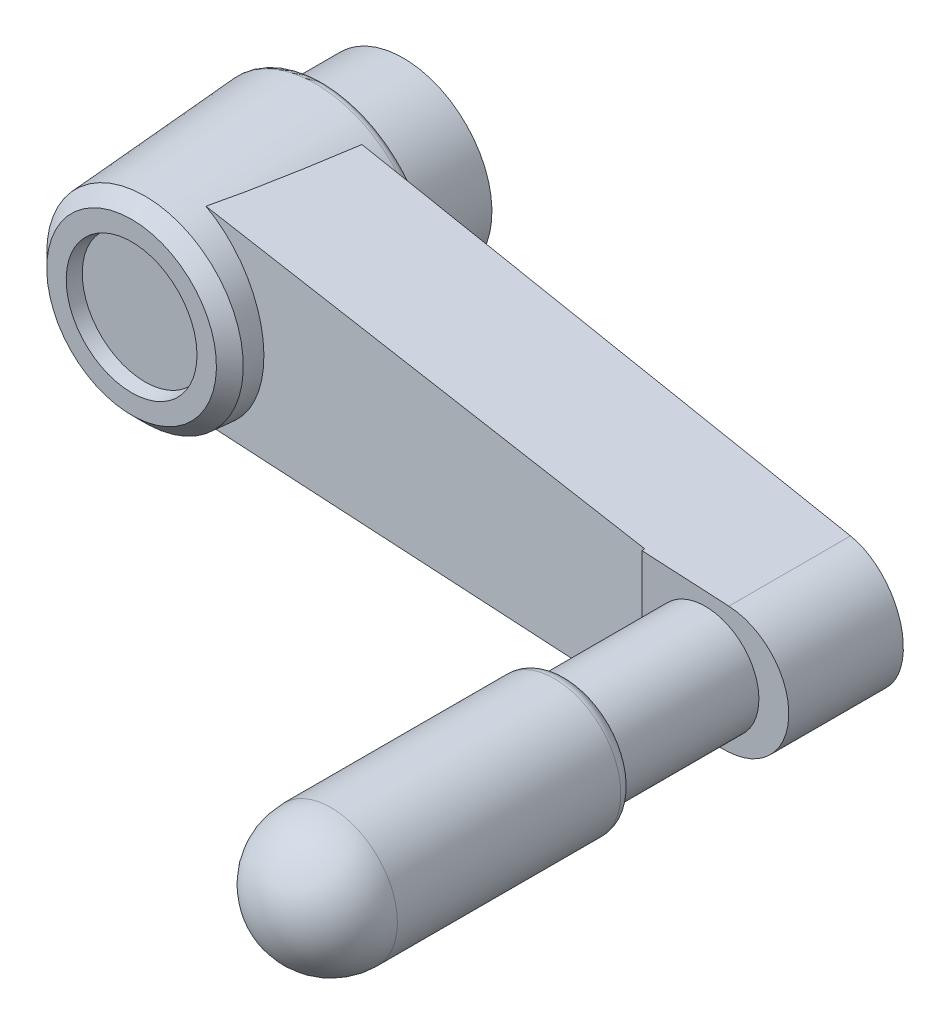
ISO-10303-21;
HEADER;
FILE_DESCRIPTION(('STEP AP214'),'2;1');
FILE_NAME('part.step','',(''),(''),'','','');
FILE_SCHEMA(('AUTOMOTIVE_DESIGN { 1 0 10303 214 1 1 1 1 }'));
ENDSEC;
DATA;
#1=APPLICATION_CONTEXT('core data for automotive mechanical design processes');
#2=APPLICATION_PROTOCOL_DEFINITION('international standard','automotive_design',2000,#1);
#3=PRODUCT_CONTEXT('',#1,'mechanical');
#4=PRODUCT('Part','Part','',(#3));
#5=PRODUCT_RELATED_PRODUCT_CATEGORY('part','',(#4));
#6=PRODUCT_DEFINITION_FORMATION('','',#4);
#7=PRODUCT_DEFINITION_CONTEXT('part definition',#1,'design');
#8=PRODUCT_DEFINITION('design','',#6,#7);
#9=PRODUCT_DEFINITION_SHAPE('','',#8);
#10=(LENGTH_UNIT() NAMED_UNIT(*) SI_UNIT(.MILLI.,.METRE.));
#11=(NAMED_UNIT(*) PLANE_ANGLE_UNIT() SI_UNIT($,.RADIAN.));
#12=(NAMED_UNIT(*) SI_UNIT($,.STERADIAN.) SOLID_ANGLE_UNIT());
#13=UNCERTAINTY_MEASURE_WITH_UNIT(LENGTH_MEASURE(1.E-05),#10,'distance_accuracy_value','');
#14=(GEOMETRIC_REPRESENTATION_CONTEXT(3) GLOBAL_UNCERTAINTY_ASSIGNED_CONTEXT((#13)) GLOBAL_UNIT_ASSIGNED_CONTEXT((#10,
#11,#12)) REPRESENTATION_CONTEXT('',''));
#15=CARTESIAN_POINT('',(0.,0.,0.));
#16=DIRECTION('',(0.,0.,1.));
#17=DIRECTION('',(1.,0.,0.));
#18=AXIS2_PLACEMENT_3D('',#15,#16,#17);
#19=CARTESIAN_POINT('',(0.,0.,24.9999999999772));
#20=DIRECTION('',(0.,0.,-1.));
#21=DIRECTION('',(0.,1.,0.));
#22=AXIS2_PLACEMENT_3D('',#19,#20,#21);
#23=CONICAL_SURFACE('',#22,4.99999999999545,1.04719755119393);
#24=CARTESIAN_POINT('',(5.6843418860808E-11,0.,27.8867513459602));
#25=VERTEX_POINT('',#24);
#26=VERTEX_LOOP('',#25);
#27=FACE_BOUND('',#26,.T.);
#28=CARTESIAN_POINT('',(0.,0.,25.));
#29=DIRECTION('',(0.,0.,-1.));
#30=DIRECTION('',(0.,1.,0.));
#31=AXIS2_PLACEMENT_3D('',#28,#29,#30);
#32=CIRCLE('',#31,5.);
#33=CARTESIAN_POINT('',(0.,5.,25.));
#34=VERTEX_POINT('',#33);
#35=EDGE_CURVE('E297',#34,#34,#32,.T.);
#36=ORIENTED_EDGE('',*,*,#35,.T.);
#37=EDGE_LOOP('',(#36));
#38=FACE_BOUND('',#37,.T.);
#39=ADVANCED_FACE('F15',(#27,#38),#23,.F.);
#40=CARTESIAN_POINT('',(0.,0.,12.875));
#41=DIRECTION('',(0.,0.,-1.));
#42=DIRECTION('',(0.,1.,0.));
#43=AXIS2_PLACEMENT_3D('',#40,#41,#42);
#44=CYLINDRICAL_SURFACE('',#43,5.);
#45=CARTESIAN_POINT('',(0.,0.,0.749999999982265));
#46=DIRECTION('',(0.,0.,-1.));
#47=DIRECTION('',(1.,0.,0.));
#48=AXIS2_PLACEMENT_3D('',#45,#46,#47);
#49=CIRCLE('',#48,5.0000000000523);
#50=CARTESIAN_POINT('',(5.0000000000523,0.,0.749999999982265));
#51=VERTEX_POINT('',#50);
#52=EDGE_CURVE('E288',#51,#51,#49,.T.);
#53=ORIENTED_EDGE('',*,*,#52,.T.);
#54=EDGE_LOOP('',(#53));
#55=FACE_BOUND('',#54,.T.);
#56=ORIENTED_EDGE('',*,*,#35,.F.);
#57=EDGE_LOOP('',(#56));
#58=FACE_BOUND('',#57,.T.);
#59=ADVANCED_FACE('F400',(#55,#58),#44,.F.);
#60=CARTESIAN_POINT('',(0.,0.,5.6843418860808E-11));
#61=DIRECTION('',(0.,0.,-1.));
#62=DIRECTION('',(0.,1.,0.));
#63=AXIS2_PLACEMENT_3D('',#60,#61,#62);
#64=CONICAL_SURFACE('',#63,5.74999999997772,0.785398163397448);
#65=CARTESIAN_POINT('',(0.,0.,5.6843418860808E-11));
#66=DIRECTION('',(0.,0.,-1.));
#67=DIRECTION('',(0.,1.,0.));
#68=AXIS2_PLACEMENT_3D('',#65,#66,#67);
#69=CIRCLE('',#68,5.74999999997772);
#70=CARTESIAN_POINT('',(0.,5.74999999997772,5.6843418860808E-11));
#71=VERTEX_POINT('',#70);
#72=EDGE_CURVE('E285',#71,#71,#69,.F.);
#73=ORIENTED_EDGE('',*,*,#72,.F.);
#74=EDGE_LOOP('',(#73));
#75=FACE_BOUND('',#74,.T.);
#76=ORIENTED_EDGE('',*,*,#52,.F.);
#77=EDGE_LOOP('',(#76));
#78=FACE_BOUND('',#77,.T.);
#79=ADVANCED_FACE('F405',(#75,#78),#64,.F.);
#80=CARTESIAN_POINT('',(-4.5,0.,0.));
#81=DIRECTION('',(0.,0.,-1.));
#82=DIRECTION('',(0.,1.,0.));
#83=AXIS2_PLACEMENT_3D('',#80,#81,#82);
#84=PLANE('',#83);
#85=CARTESIAN_POINT('',(0.,0.,0.));
#86=DIRECTION('',(0.,0.,1.));
#87=DIRECTION('',(0.,-1.,0.));
#88=AXIS2_PLACEMENT_3D('',#85,#86,#87);
#89=CIRCLE('',#88,9.);
#90=CARTESIAN_POINT('',(0.,-9.,0.));
#91=VERTEX_POINT('',#90);
#92=EDGE_CURVE('E282',#91,#91,#89,.T.);
#93=ORIENTED_EDGE('',*,*,#92,.F.);
#94=EDGE_LOOP('',(#93));
#95=FACE_BOUND('',#94,.T.);
#96=ORIENTED_EDGE('',*,*,#72,.T.);
#97=EDGE_LOOP('',(#96));
#98=FACE_BOUND('',#97,.T.);
#99=ADVANCED_FACE('F521',(#95,#98),#84,.T.);
#100=CARTESIAN_POINT('',(0.,0.,0.0999999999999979));
#101=DIRECTION('',(0.,0.,1.));
#102=DIRECTION('',(0.,-1.,0.));
#103=AXIS2_PLACEMENT_3D('',#100,#101,#102);
#104=CYLINDRICAL_SURFACE('',#103,9.);
#105=ORIENTED_EDGE('',*,*,#92,.T.);
#106=EDGE_LOOP('',(#105));
#107=FACE_BOUND('',#106,.T.);
#108=CARTESIAN_POINT('',(0.,0.,0.199999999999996));
#109=DIRECTION('',(0.,0.,1.));
#110=DIRECTION('',(0.,-1.,0.));
#111=AXIS2_PLACEMENT_3D('',#108,#109,#110);
#112=CIRCLE('',#111,9.);
#113=CARTESIAN_POINT('',(0.,-9.,0.199999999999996));
#114=VERTEX_POINT('',#113);
#115=EDGE_CURVE('E279',#114,#114,#112,.T.);
#116=ORIENTED_EDGE('',*,*,#115,.F.);
#117=EDGE_LOOP('',(#116));
#118=FACE_BOUND('',#117,.T.);
#119=ADVANCED_FACE('F517',(#107,#118),#104,.T.);
#120=CARTESIAN_POINT('',(-10.5,0.,0.199999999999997));
#121=DIRECTION('',(0.,0.,-1.));
#122=DIRECTION('',(1.,0.,0.));
#123=AXIS2_PLACEMENT_3D('',#120,#121,#122);
#124=PLANE('',#123);
#125=CARTESIAN_POINT('',(0.,0.,0.2));
#126=DIRECTION('',(0.,0.,1.));
#127=DIRECTION('',(0.,-1.,0.));
#128=AXIS2_PLACEMENT_3D('',#125,#126,#127);
#129=CIRCLE('',#128,12.);
#130=CARTESIAN_POINT('',(0.,-12.,0.2));
#131=VERTEX_POINT('',#130);
#132=EDGE_CURVE('E272',#131,#131,#129,.T.);
#133=ORIENTED_EDGE('',*,*,#132,.F.);
#134=EDGE_LOOP('',(#133));
#135=FACE_BOUND('',#134,.T.);
#136=ORIENTED_EDGE('',*,*,#115,.T.);
#137=EDGE_LOOP('',(#136));
#138=FACE_BOUND('',#137,.T.);
#139=ADVANCED_FACE('F512',(#135,#138),#124,.T.);
#140=CARTESIAN_POINT('',(-4.25,0.,35.18));
#141=DIRECTION('',(0.,0.,1.));
#142=DIRECTION('',(0.,-1.,0.));
#143=AXIS2_PLACEMENT_3D('',#140,#141,#142);
#144=PLANE('',#143);
#145=CARTESIAN_POINT('',(0.,0.,35.18));
#146=DIRECTION('',(0.,0.,1.));
#147=DIRECTION('',(0.,-1.,0.));
#148=AXIS2_PLACEMENT_3D('',#145,#146,#147);
#149=CIRCLE('',#148,8.5);
#150=CARTESIAN_POINT('',(0.,-8.5,35.18));
#151=VERTEX_POINT('',#150);
#152=EDGE_CURVE('E264',#151,#151,#149,.T.);
#153=ORIENTED_EDGE('',*,*,#152,.T.);
#154=EDGE_LOOP('',(#153));
#155=FACE_BOUND('',#154,.T.);
#156=ADVANCED_FACE('F243',(#155),#144,.T.);
#157=CARTESIAN_POINT('',(0.,0.,5.6));
#158=DIRECTION('',(0.,0.,1.));
#159=DIRECTION('',(0.,-1.,0.));
#160=AXIS2_PLACEMENT_3D('',#157,#158,#159);
#161=CYLINDRICAL_SURFACE('',#160,12.);
#162=ORIENTED_EDGE('',*,*,#132,.T.);
#163=EDGE_LOOP('',(#162));
#164=FACE_BOUND('',#163,.T.);
#165=CARTESIAN_POINT('',(0.,0.,11.));
#166=DIRECTION('',(0.,0.,1.));
#167=DIRECTION('',(0.,-1.,0.));
#168=AXIS2_PLACEMENT_3D('',#165,#166,#167);
#169=CIRCLE('',#168,12.);
#170=CARTESIAN_POINT('',(0.,-12.,11.));
#171=VERTEX_POINT('',#170);
#172=EDGE_CURVE('E267',#171,#171,#169,.T.);
#173=ORIENTED_EDGE('',*,*,#172,.F.);
#174=EDGE_LOOP('',(#173));
#175=FACE_BOUND('',#174,.T.);
#176=ADVANCED_FACE('F504',(#164,#175),#161,.T.);
#177=CARTESIAN_POINT('',(0.,0.,37.));
#178=DIRECTION('',(0.,0.,1.));
#179=DIRECTION('',(0.,-1.,0.));
#180=AXIS2_PLACEMENT_3D('',#177,#178,#179);
#181=CONICAL_SURFACE('',#180,8.85377216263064,0.191986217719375);
#182=CARTESIAN_POINT('',(0.,0.,37.));
#183=DIRECTION('',(0.,0.,1.));
#184=DIRECTION('',(0.,-1.,0.));
#185=AXIS2_PLACEMENT_3D('',#182,#183,#184);
#186=CIRCLE('',#185,8.85377216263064);
#187=CARTESIAN_POINT('',(0.,-8.85377216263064,37.));
#188=VERTEX_POINT('',#187);
#189=EDGE_CURVE('E218',#188,#188,#186,.F.);
#190=ORIENTED_EDGE('',*,*,#189,.F.);
#191=EDGE_LOOP('',(#190));
#192=FACE_BOUND('',#191,.T.);
#193=ORIENTED_EDGE('',*,*,#152,.F.);
#194=EDGE_LOOP('',(#193));
#195=FACE_BOUND('',#194,.T.);
#196=ADVANCED_FACE('F241',(#192,#195),#181,.F.);
#197=CARTESIAN_POINT('',(-12.9638156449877,0.,11.));
#198=DIRECTION('',(0.,0.,-1.));
#199=DIRECTION('',(1.,0.,0.));
#200=AXIS2_PLACEMENT_3D('',#197,#198,#199);
#201=PLANE('',#200);
#202=CARTESIAN_POINT('',(0.,0.,11.));
#203=DIRECTION('',(0.,0.,1.));
#204=DIRECTION('',(0.,-1.,0.));
#205=AXIS2_PLACEMENT_3D('',#202,#203,#204);
#206=CIRCLE('',#205,13.9276312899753);
#207=CARTESIAN_POINT('',(0.,-13.9276312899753,11.));
#208=VERTEX_POINT('',#207);
#209=CARTESIAN_POINT('',(0.,13.9276312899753,11.));
#210=VERTEX_POINT('',#209);
#211=EDGE_CURVE('E148',#208,#210,#206,.T.);
#212=ORIENTED_EDGE('',*,*,#211,.F.);
#213=CARTESIAN_POINT('',(0.,0.,11.));
#214=DIRECTION('',(0.,0.,1.));
#215=DIRECTION('',(-1.,0.,0.));
#216=AXIS2_PLACEMENT_3D('',#213,#214,#215);
#217=CIRCLE('',#216,13.9276312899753);
#218=CARTESIAN_POINT('',(-13.9276312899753,0.,11.));
#219=VERTEX_POINT('',#218);
#220=EDGE_CURVE('E260',#219,#208,#217,.T.);
#221=ORIENTED_EDGE('',*,*,#220,.F.);
#222=CARTESIAN_POINT('',(0.,0.,11.));
#223=DIRECTION('',(0.,0.,1.));
#224=DIRECTION('',(0.,1.,0.));
#225=AXIS2_PLACEMENT_3D('',#222,#223,#224);
#226=CIRCLE('',#225,13.9276312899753);
#227=EDGE_CURVE('E224',#210,#219,#226,.T.);
#228=ORIENTED_EDGE('',*,*,#227,.F.);
#229=EDGE_LOOP('',(#212,#221,#228));
#230=FACE_BOUND('',#229,.T.);
#231=ORIENTED_EDGE('',*,*,#172,.T.);
#232=EDGE_LOOP('',(#231));
#233=FACE_BOUND('',#232,.T.);
#234=ADVANCED_FACE('F230',(#230,#233),#201,.T.);
#235=CARTESIAN_POINT('',(-10.1714709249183,0.,37.));
#236=DIRECTION('',(0.,0.,1.));
#237=DIRECTION('',(0.,-1.,0.));
#238=AXIS2_PLACEMENT_3D('',#235,#236,#237);
#239=PLANE('',#238);
#240=ORIENTED_EDGE('',*,*,#189,.T.);
#241=EDGE_LOOP('',(#240));
#242=FACE_BOUND('',#241,.T.);
#243=CARTESIAN_POINT('',(0.,0.,37.));
#244=DIRECTION('',(0.,0.,-1.));
#245=DIRECTION('',(0.,1.,0.));
#246=AXIS2_PLACEMENT_3D('',#243,#244,#245);
#247=CIRCLE('',#246,11.4891696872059);
#248=CARTESIAN_POINT('',(0.,11.4891696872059,37.));
#249=VERTEX_POINT('',#248);
#250=EDGE_CURVE('E198',#249,#249,#247,.T.);
#251=ORIENTED_EDGE('',*,*,#250,.F.);
#252=EDGE_LOOP('',(#251));
#253=FACE_BOUND('',#252,.T.);
#254=ADVANCED_FACE('F240',(#242,#253),#239,.T.);
#255=CARTESIAN_POINT('',(0.,0.,35.18));
#256=DIRECTION('',(0.,0.,-1.));
#257=DIRECTION('',(0.,1.,0.));
#258=AXIS2_PLACEMENT_3D('',#255,#256,#257);
#259=CONICAL_SURFACE('',#258,13.3091696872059,0.785398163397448);
#260=CARTESIAN_POINT('',(0.,0.,35.18));
#261=DIRECTION('',(0.,0.,-1.));
#262=DIRECTION('',(-1.,0.,0.));
#263=AXIS2_PLACEMENT_3D('',#260,#261,#262);
#264=CIRCLE('',#263,13.3091696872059);
#265=CARTESIAN_POINT('',(-13.3091696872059,0.,35.18));
#266=VERTEX_POINT('',#265);
#267=EDGE_CURVE('E178',#266,#266,#264,.T.);
#268=ORIENTED_EDGE('',*,*,#267,.F.);
#269=EDGE_LOOP('',(#268));
#270=FACE_BOUND('',#269,.T.);
#271=ORIENTED_EDGE('',*,*,#250,.T.);
#272=EDGE_LOOP('',(#271));
#273=FACE_BOUND('',#272,.T.);
#274=ADVANCED_FACE('F167',(#270,#273),#259,.T.);
#275=CARTESIAN_POINT('',(0.,0.,12.));
#276=DIRECTION('',(0.,0.,-1.));
#277=DIRECTION('',(0.,1.,0.));
#278=AXIS2_PLACEMENT_3D('',#275,#276,#277);
#279=TOROIDAL_SURFACE('',#278,13.9276312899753,1.);
#280=ORIENTED_EDGE('',*,*,#220,.T.);
#281=ORIENTED_EDGE('',*,*,#211,.T.);
#282=ORIENTED_EDGE('',*,*,#227,.T.);
#283=EDGE_LOOP('',(#280,#281,#282));
#284=FACE_BOUND('',#283,.T.);
#285=CARTESIAN_POINT('',(0.,0.,12.0697564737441));
#286=DIRECTION('',(0.,0.,-1.));
#287=DIRECTION('',(-1.,0.,0.));
#288=AXIS2_PLACEMENT_3D('',#285,#286,#287);
#289=CIRCLE('',#288,14.9251953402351);
#290=CARTESIAN_POINT('',(-14.9251953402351,0.,12.0697564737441));
#291=VERTEX_POINT('',#290);
#292=EDGE_CURVE('E176',#291,#291,#289,.F.);
#293=ORIENTED_EDGE('',*,*,#292,.F.);
#294=EDGE_LOOP('',(#293));
#295=FACE_BOUND('',#294,.T.);
#296=ADVANCED_FACE('F155',(#284,#295),#279,.T.);
#297=CARTESIAN_POINT('',(-14.9,-26.,29.6));
#298=DIRECTION('',(0.104082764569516,0.,-0.994568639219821));
#299=DIRECTION('',(0.994568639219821,0.,0.104082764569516));
#300=AXIS2_PLACEMENT_3D('',#297,#298,#299);
#301=PLANE('',#300);
#302=CARTESIAN_POINT('',(-0.0994582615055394,0.,31.1488939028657));
#303=DIRECTION('',(0.104082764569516,0.,-0.994568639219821));
#304=DIRECTION('',(-0.994568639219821,0.,-0.104082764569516));
#305=AXIS2_PLACEMENT_3D('',#302,#303,#304);
#306=ELLIPSE('',#305,13.6652731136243,13.5906881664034);
#307=CARTESIAN_POINT('',(4.71940161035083,-12.7077392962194,31.6531931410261));
#308=VERTEX_POINT('',#307);
#309=CARTESIAN_POINT('',(4.71940160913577,12.7077392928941,31.6531931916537));
#310=VERTEX_POINT('',#309);
#311=EDGE_CURVE('E182',#308,#310,#306,.F.);
#312=ORIENTED_EDGE('',*,*,#311,.F.);
#313=DIRECTION('',(-0.993185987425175,-0.0527112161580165,-0.103938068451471));
#314=VECTOR('',#313,1.);
#315=CARTESIAN_POINT('',(71.1,-9.18473140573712,38.6));
#316=LINE('',#315,#314);
#317=CARTESIAN_POINT('',(71.1,-9.18473140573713,38.6));
#318=VERTEX_POINT('',#317);
#319=EDGE_CURVE('E204',#318,#308,#316,.T.);
#320=ORIENTED_EDGE('',*,*,#319,.F.);
#321=DIRECTION('',(0.,-1.,0.));
#322=VECTOR('',#321,1.);
#323=CARTESIAN_POINT('',(71.1,-26.,38.6));
#324=LINE('',#323,#322);
#325=CARTESIAN_POINT('',(71.1,9.18473140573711,38.6));
#326=VERTEX_POINT('',#325);
#327=EDGE_CURVE('E192',#326,#318,#324,.T.);
#328=ORIENTED_EDGE('',*,*,#327,.F.);
#329=DIRECTION('',(0.993185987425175,-0.0527112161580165,0.103938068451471));
#330=VECTOR('',#329,1.);
#331=CARTESIAN_POINT('',(4.71940159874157,12.7077392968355,31.653193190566));
#332=LINE('',#331,#330);
#333=EDGE_CURVE('E186',#310,#326,#332,.T.);
#334=ORIENTED_EDGE('',*,*,#333,.F.);
#335=EDGE_LOOP('',(#312,#320,#328,#334));
#336=FACE_BOUND('',#335,.T.);
#337=ADVANCED_FACE('F166',(#336),#301,.F.);
#338=CARTESIAN_POINT('',(0.,0.,12.0697564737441));
#339=DIRECTION('',(0.,0.,-1.));
#340=DIRECTION('',(0.,1.,0.));
#341=AXIS2_PLACEMENT_3D('',#338,#339,#340);
#342=CONICAL_SURFACE('',#341,14.9251953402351,0.0698131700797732);
#343=ORIENTED_EDGE('',*,*,#292,.T.);
#344=EDGE_LOOP('',(#343));
#345=FACE_BOUND('',#344,.T.);
#346=CARTESIAN_POINT('',(-0.122686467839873,0.,12.7426077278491));
#347=DIRECTION('',(-0.117113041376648,0.,0.993118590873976));
#348=DIRECTION('',(-0.993118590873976,0.,-0.117113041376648));
#349=AXIS2_PLACEMENT_3D('',#346,#347,#348);
#350=ELLIPSE('',#349,14.9812370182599,14.8776391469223);
#351=CARTESIAN_POINT('',(7.88367774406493,12.5398021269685,13.6867545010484));
#352=VERTEX_POINT('',#351);
#353=CARTESIAN_POINT('',(7.883677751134,-12.5398021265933,13.6867544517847));
#354=VERTEX_POINT('',#353);
#355=EDGE_CURVE('E292',#352,#354,#350,.F.);
#356=ORIENTED_EDGE('',*,*,#355,.T.);
#357=CARTESIAN_POINT('',(7.88367775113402,-12.5398021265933,13.6867544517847));
#358=CARTESIAN_POINT('',(7.77563997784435,-12.5455359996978,14.4394856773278));
#359=CARTESIAN_POINT('',(7.66583067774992,-12.551363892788,15.1919658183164));
#360=CARTESIAN_POINT('',(7.4420278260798,-12.5632417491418,16.6963025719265));
#361=CARTESIAN_POINT('',(7.328034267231,-12.5692917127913,17.448159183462));
#362=CARTESIAN_POINT('',(7.09526884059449,-12.5816452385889,18.9508229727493));
#363=CARTESIAN_POINT('',(6.97649891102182,-12.5879486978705,19.7016304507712));
#364=CARTESIAN_POINT('',(6.73327379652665,-12.600857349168,21.2023210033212));
#365=CARTESIAN_POINT('',(6.60881863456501,-12.6074625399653,21.9522040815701));
#366=CARTESIAN_POINT('',(6.35307551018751,-12.6210355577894,23.4509159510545));
#367=CARTESIAN_POINT('',(6.221786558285,-12.6280034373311,24.1997445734));
#368=CARTESIAN_POINT('',(5.95087096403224,-12.6423817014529,25.6958702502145));
#369=CARTESIAN_POINT('',(5.81124463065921,-12.6497920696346,26.4431673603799));
#370=CARTESIAN_POINT('',(5.59386528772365,-12.661329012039,27.5627257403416));
#371=CARTESIAN_POINT('',(5.52006610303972,-12.6652457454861,27.9357577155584));
#372=CARTESIAN_POINT('',(5.3694467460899,-12.6732395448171,28.6812069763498));
#373=CARTESIAN_POINT('',(5.29262660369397,-12.6773166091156,29.0536242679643));
#374=CARTESIAN_POINT('',(5.13550996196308,-12.6856552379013,29.7977731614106));
#375=CARTESIAN_POINT('',(5.05521303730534,-12.6899168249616,30.1695046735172));
#376=CARTESIAN_POINT('',(4.89052922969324,-12.6986570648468,30.9120700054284));
#377=CARTESIAN_POINT('',(4.80614220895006,-12.7031357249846,31.2829037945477));
#378=CARTESIAN_POINT('',(4.71940162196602,-12.7077392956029,31.6531930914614));
#379=B_SPLINE_CURVE_WITH_KNOTS('',3,(#357,#358,#359,#360,#361,#362,#363,#364,#365,#366,#367,
#368,#369,#370,#371,#372,#373,#374,#375,#376,#377,#378),.UNSPECIFIED.,.F.,.F.,(4,2,2,2,2,2,2,2,
2,2,4),(0.,2.28140321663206,4.56281039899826,6.84330096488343,9.12378232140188,11.4045947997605,
13.6853228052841,14.826159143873,15.9669842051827,17.1079492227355,18.2489527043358),.UNSPECIFIED.);
#380=EDGE_CURVE('E424',#354,#308,#379,.T.);
#381=ORIENTED_EDGE('',*,*,#380,.T.);
#382=ORIENTED_EDGE('',*,*,#311,.T.);
#383=CARTESIAN_POINT('',(4.71940159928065,12.7077392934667,31.6531931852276));
#384=CARTESIAN_POINT('',(4.80614218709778,12.7031357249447,31.2829038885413));
#385=CARTESIAN_POINT('',(4.890529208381,12.6986570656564,30.9120700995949));
#386=CARTESIAN_POINT('',(5.05521301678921,12.6899168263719,30.169504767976));
#387=CARTESIAN_POINT('',(5.13550994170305,12.6856552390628,29.7977732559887));
#388=CARTESIAN_POINT('',(5.29262658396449,12.6773166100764,29.0536243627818));
#389=CARTESIAN_POINT('',(5.36944672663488,12.673239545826,28.6812070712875));
#390=CARTESIAN_POINT('',(5.52006608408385,12.6652457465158,27.9357578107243));
#391=CARTESIAN_POINT('',(5.59386526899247,12.6613290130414,27.5627258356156));
#392=CARTESIAN_POINT('',(5.81124461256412,12.6497920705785,26.4431674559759));
#393=CARTESIAN_POINT('',(5.95087094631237,12.6423817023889,25.6958703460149));
#394=CARTESIAN_POINT('',(6.22178654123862,12.6280034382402,24.1997446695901));
#395=CARTESIAN_POINT('',(6.35307549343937,12.6210355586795,23.4509160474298));
#396=CARTESIAN_POINT('',(6.60881861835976,12.6074625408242,21.9522041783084));
#397=CARTESIAN_POINT('',(6.73327378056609,12.6008573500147,21.2023211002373));
#398=CARTESIAN_POINT('',(6.97649889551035,12.5879486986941,19.7016305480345));
#399=CARTESIAN_POINT('',(7.09526882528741,12.5816452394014,18.950823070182));
#400=CARTESIAN_POINT('',(7.328034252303,12.5692917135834,17.4481592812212));
#401=CARTESIAN_POINT('',(7.44202781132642,12.5632417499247,16.6963026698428));
#402=CARTESIAN_POINT('',(7.66583066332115,12.5513638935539,15.1919659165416));
#403=CARTESIAN_POINT('',(7.77563996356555,12.5455360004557,14.439485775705));
#404=CARTESIAN_POINT('',(7.88367773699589,12.5398021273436,13.6867545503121));
#405=B_SPLINE_CURVE_WITH_KNOTS('',3,(#383,#384,#385,#386,#387,#388,#389,#390,#391,#392,#393,
#394,#395,#396,#397,#398,#399,#400,#401,#402,#403,#404),.UNSPECIFIED.,.F.,.F.,(4,2,2,2,2,2,2,2,
2,2,4),(0.,1.1410034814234,2.28196849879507,3.42279355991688,4.56362989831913,6.84435790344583,
9.12517038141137,11.4056517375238,13.6861423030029,15.9675494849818,18.2489527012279),.UNSPECIFIED.);
#406=EDGE_CURVE('E37',#310,#352,#405,.T.);
#407=ORIENTED_EDGE('',*,*,#406,.T.);
#408=EDGE_LOOP('',(#356,#381,#382,#407));
#409=FACE_BOUND('',#408,.T.);
#410=ORIENTED_EDGE('',*,*,#267,.T.);
#411=EDGE_LOOP('',(#410));
#412=FACE_BOUND('',#411,.T.);
#413=ADVANCED_FACE('F443',(#345,#409,#412),#342,.T.);
#414=CARTESIAN_POINT('',(0.685797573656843,-12.9218141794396,63.));
#415=DIRECTION('',(0.052998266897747,-0.998594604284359,0.));
#416=DIRECTION('',(0.998594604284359,0.052998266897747,0.));
#417=AXIS2_PLACEMENT_3D('',#414,#415,#416);
#418=PLANE('',#417);
#419=DIRECTION('',(-1.42108547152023E-13,0.,1.));
#420=VECTOR('',#419,1.);
#421=CARTESIAN_POINT('',(71.1,-9.18473140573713,38.6));
#422=LINE('',#421,#420);
#423=CARTESIAN_POINT('',(71.1,-9.18473140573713,39.));
#424=VERTEX_POINT('',#423);
#425=EDGE_CURVE('E213',#424,#318,#422,.F.);
#426=ORIENTED_EDGE('',*,*,#425,.T.);
#427=ORIENTED_EDGE('',*,*,#319,.T.);
#428=ORIENTED_EDGE('',*,*,#380,.F.);
#429=DIRECTION('',(0.991741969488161,0.0526345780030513,0.116950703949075));
#430=VECTOR('',#429,1.);
#431=CARTESIAN_POINT('',(7.88367775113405,-12.5398021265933,13.6867544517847));
#432=LINE('',#431,#430);
#433=CARTESIAN_POINT('',(82.882842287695,-8.55938232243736,22.5309955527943));
#434=VERTEX_POINT('',#433);
#435=EDGE_CURVE('E420',#354,#434,#432,.T.);
#436=ORIENTED_EDGE('',*,*,#435,.T.);
#437=DIRECTION('',(0.,0.,1.));
#438=VECTOR('',#437,1.);
#439=CARTESIAN_POINT('',(82.882842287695,-8.55938232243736,63.));
#440=LINE('',#439,#438);
#441=CARTESIAN_POINT('',(82.882842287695,-8.55938232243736,39.));
#442=VERTEX_POINT('',#441);
#443=EDGE_CURVE('E466',#442,#434,#440,.F.);
#444=ORIENTED_EDGE('',*,*,#443,.F.);
#445=DIRECTION('',(0.998594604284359,0.052998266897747,0.));
#446=VECTOR('',#445,1.);
#447=CARTESIAN_POINT('',(0.685797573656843,-12.9218141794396,39.));
#448=LINE('',#447,#446);
#449=EDGE_CURVE('E201',#442,#424,#448,.F.);
#450=ORIENTED_EDGE('',*,*,#449,.T.);
#451=EDGE_LOOP('',(#426,#427,#428,#436,#444,#450));
#452=FACE_BOUND('',#451,.T.);
#453=ADVANCED_FACE('F439',(#452),#418,.T.);
#454=CARTESIAN_POINT('',(71.1,-26.,38.6));
#455=DIRECTION('',(1.,0.,1.42108547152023E-13));
#456=DIRECTION('',(-1.42108547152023E-13,0.,1.));
#457=AXIS2_PLACEMENT_3D('',#454,#455,#456);
#458=PLANE('',#457);
#459=DIRECTION('',(0.,1.,0.));
#460=VECTOR('',#459,1.);
#461=CARTESIAN_POINT('',(71.1,-26.,39.));
#462=LINE('',#461,#460);
#463=CARTESIAN_POINT('',(71.1,9.18473140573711,39.));
#464=VERTEX_POINT('',#463);
#465=EDGE_CURVE('E189',#424,#464,#462,.T.);
#466=ORIENTED_EDGE('',*,*,#465,.T.);
#467=DIRECTION('',(-1.42108547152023E-13,0.,1.));
#468=VECTOR('',#467,1.);
#469=CARTESIAN_POINT('',(71.1,9.18473140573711,38.6));
#470=LINE('',#469,#468);
#471=EDGE_CURVE('E210',#326,#464,#470,.T.);
#472=ORIENTED_EDGE('',*,*,#471,.F.);
#473=ORIENTED_EDGE('',*,*,#327,.T.);
#474=ORIENTED_EDGE('',*,*,#425,.F.);
#475=EDGE_LOOP('',(#466,#472,#473,#474));
#476=FACE_BOUND('',#475,.T.);
#477=ADVANCED_FACE('F454',(#476),#458,.F.);
#478=CARTESIAN_POINT('',(82.882842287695,8.55938232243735,63.));
#479=DIRECTION('',(0.052998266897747,0.998594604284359,0.));
#480=DIRECTION('',(-0.998594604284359,0.052998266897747,0.));
#481=AXIS2_PLACEMENT_3D('',#478,#479,#480);
#482=PLANE('',#481);
#483=DIRECTION('',(0.,0.,1.));
#484=VECTOR('',#483,1.);
#485=CARTESIAN_POINT('',(82.882842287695,8.55938232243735,63.));
#486=LINE('',#485,#484);
#487=CARTESIAN_POINT('',(82.882842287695,8.55938232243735,39.));
#488=VERTEX_POINT('',#487);
#489=CARTESIAN_POINT('',(82.882842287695,8.55938232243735,22.5309955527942));
#490=VERTEX_POINT('',#489);
#491=EDGE_CURVE('E185',#488,#490,#486,.F.);
#492=ORIENTED_EDGE('',*,*,#491,.T.);
#493=DIRECTION('',(-0.991741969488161,0.0526345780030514,-0.116950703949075));
#494=VECTOR('',#493,1.);
#495=CARTESIAN_POINT('',(82.882842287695,8.55938232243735,22.5309955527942));
#496=LINE('',#495,#494);
#497=EDGE_CURVE('E416',#490,#352,#496,.T.);
#498=ORIENTED_EDGE('',*,*,#497,.T.);
#499=ORIENTED_EDGE('',*,*,#406,.F.);
#500=ORIENTED_EDGE('',*,*,#333,.T.);
#501=ORIENTED_EDGE('',*,*,#471,.T.);
#502=DIRECTION('',(-0.998594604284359,0.052998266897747,0.));
#503=VECTOR('',#502,1.);
#504=CARTESIAN_POINT('',(82.882842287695,8.55938232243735,39.));
#505=LINE('',#504,#503);
#506=EDGE_CURVE('E183',#464,#488,#505,.F.);
#507=ORIENTED_EDGE('',*,*,#506,.T.);
#508=EDGE_LOOP('',(#492,#498,#499,#500,#501,#507));
#509=FACE_BOUND('',#508,.T.);
#510=ADVANCED_FACE('F449',(#509),#482,.T.);
#511=CARTESIAN_POINT('',(82.4285714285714,0.,63.));
#512=DIRECTION('',(0.,0.,1.));
#513=DIRECTION('',(0.,-1.,0.));
#514=AXIS2_PLACEMENT_3D('',#511,#512,#513);
#515=CYLINDRICAL_SURFACE('',#514,8.57142857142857);
#516=CARTESIAN_POINT('',(82.4285714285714,0.,22.4774258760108));
#517=DIRECTION('',(-0.117113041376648,0.,0.993118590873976));
#518=DIRECTION('',(0.993118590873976,0.,0.117113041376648));
#519=AXIS2_PLACEMENT_3D('',#516,#517,#518);
#520=ELLIPSE('',#519,8.63082078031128,8.57142857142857);
#521=EDGE_CURVE('E417',#434,#490,#520,.T.);
#522=ORIENTED_EDGE('',*,*,#521,.T.);
#523=ORIENTED_EDGE('',*,*,#491,.F.);
#524=CARTESIAN_POINT('',(82.4285714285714,0.,39.));
#525=DIRECTION('',(0.,0.,1.));
#526=DIRECTION('',(0.,-1.,0.));
#527=AXIS2_PLACEMENT_3D('',#524,#525,#526);
#528=CIRCLE('',#527,8.57142857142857);
#529=EDGE_CURVE('E487',#488,#442,#528,.F.);
#530=ORIENTED_EDGE('',*,*,#529,.T.);
#531=ORIENTED_EDGE('',*,*,#443,.T.);
#532=EDGE_LOOP('',(#522,#523,#530,#531));
#533=FACE_BOUND('',#532,.T.);
#534=ADVANCED_FACE('F453',(#533),#515,.T.);
#535=CARTESIAN_POINT('',(71.1,-26.,39.));
#536=DIRECTION('',(0.,0.,-1.));
#537=DIRECTION('',(0.,1.,0.));
#538=AXIS2_PLACEMENT_3D('',#535,#536,#537);
#539=PLANE('',#538);
#540=CARTESIAN_POINT('',(80.,0.,39.));
#541=DIRECTION('',(0.,0.,-1.));
#542=DIRECTION('',(0.,1.,0.));
#543=AXIS2_PLACEMENT_3D('',#540,#541,#542);
#544=CIRCLE('',#543,5.4375);
#545=CARTESIAN_POINT('',(80.,5.4375,39.));
#546=VERTEX_POINT('',#545);
#547=EDGE_CURVE('E9',#546,#546,#544,.T.);
#548=ORIENTED_EDGE('',*,*,#547,.T.);
#549=EDGE_LOOP('',(#548));
#550=FACE_BOUND('',#549,.T.);
#551=ORIENTED_EDGE('',*,*,#529,.F.);
#552=ORIENTED_EDGE('',*,*,#506,.F.);
#553=ORIENTED_EDGE('',*,*,#465,.F.);
#554=ORIENTED_EDGE('',*,*,#449,.F.);
#555=EDGE_LOOP('',(#551,#552,#553,#554));
#556=FACE_BOUND('',#555,.T.);
#557=ADVANCED_FACE('F169',(#550,#556),#539,.F.);
#558=CARTESIAN_POINT('',(91.1,-26.,23.5));
#559=DIRECTION('',(-0.117113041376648,0.,0.993118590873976));
#560=DIRECTION('',(-0.993118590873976,0.,-0.117113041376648));
#561=AXIS2_PLACEMENT_3D('',#558,#559,#560);
#562=PLANE('',#561);
#563=ORIENTED_EDGE('',*,*,#355,.F.);
#564=ORIENTED_EDGE('',*,*,#497,.F.);
#565=ORIENTED_EDGE('',*,*,#521,.F.);
#566=ORIENTED_EDGE('',*,*,#435,.F.);
#567=EDGE_LOOP('',(#563,#564,#565,#566));
#568=FACE_BOUND('',#567,.T.);
#569=CARTESIAN_POINT('',(80.,0.,22.191037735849));
#570=DIRECTION('',(-0.117113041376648,0.,0.993118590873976));
#571=DIRECTION('',(-0.993118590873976,0.,-0.117113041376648));
#572=AXIS2_PLACEMENT_3D('',#569,#570,#571);
#573=ELLIPSE('',#572,2.47553517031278,2.4585);
#574=CARTESIAN_POINT('',(77.5415,0.,21.9011202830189));
#575=VERTEX_POINT('',#574);
#576=EDGE_CURVE('E181',#575,#575,#573,.F.);
#577=ORIENTED_EDGE('',*,*,#576,.F.);
#578=EDGE_LOOP('',(#577));
#579=FACE_BOUND('',#578,.T.);
#580=ADVANCED_FACE('F448',(#568,#579),#562,.F.);
#581=CARTESIAN_POINT('',(80.,0.,29.97925));
#582=DIRECTION('',(0.,0.,-1.));
#583=DIRECTION('',(0.,1.,0.));
#584=AXIS2_PLACEMENT_3D('',#581,#582,#583);
#585=CYLINDRICAL_SURFACE('',#584,2.4585);
#586=ORIENTED_EDGE('',*,*,#576,.T.);
#587=EDGE_LOOP('',(#586));
#588=FACE_BOUND('',#587,.T.);
#589=CARTESIAN_POINT('',(80.,0.,26.0720000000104));
#590=DIRECTION('',(0.,0.,1.));
#591=DIRECTION('',(0.,-1.,0.));
#592=AXIS2_PLACEMENT_3D('',#589,#590,#591);
#593=CIRCLE('',#592,2.4585);
#594=CARTESIAN_POINT('',(80.,-2.4585,26.0720000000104));
#595=VERTEX_POINT('',#594);
#596=EDGE_CURVE('E28',#595,#595,#593,.T.);
#597=ORIENTED_EDGE('',*,*,#596,.T.);
#598=EDGE_LOOP('',(#597));
#599=FACE_BOUND('',#598,.T.);
#600=ADVANCED_FACE('F397',(#588,#599),#585,.F.);
#601=CARTESIAN_POINT('',(80.,0.,29.));
#602=DIRECTION('',(0.,0.,1.));
#603=DIRECTION('',(0.,-1.,0.));
#604=AXIS2_PLACEMENT_3D('',#601,#602,#603);
#605=PLANE('',#604);
#606=DIRECTION('',(-0.866025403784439,0.5,0.));
#607=VECTOR('',#606,1.);
#608=CARTESIAN_POINT('',(80.,1.73205080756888,29.));
#609=LINE('',#608,#607);
#610=CARTESIAN_POINT('',(80.,1.73205080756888,29.));
#611=VERTEX_POINT('',#610);
#612=CARTESIAN_POINT('',(81.5,0.86602540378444,29.));
#613=VERTEX_POINT('',#612);
#614=EDGE_CURVE('E343',#611,#613,#609,.F.);
#615=ORIENTED_EDGE('',*,*,#614,.T.);
#616=DIRECTION('',(0.,-1.,0.));
#617=VECTOR('',#616,1.);
#618=CARTESIAN_POINT('',(81.5,0.,29.));
#619=LINE('',#618,#617);
#620=CARTESIAN_POINT('',(81.5,-0.866025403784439,29.));
#621=VERTEX_POINT('',#620);
#622=EDGE_CURVE('E354',#621,#613,#619,.F.);
#623=ORIENTED_EDGE('',*,*,#622,.F.);
#624=DIRECTION('',(0.866025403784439,0.5,0.));
#625=VECTOR('',#624,1.);
#626=CARTESIAN_POINT('',(81.5,-0.866025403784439,29.));
#627=LINE('',#626,#625);
#628=CARTESIAN_POINT('',(80.,-1.73205080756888,29.));
#629=VERTEX_POINT('',#628);
#630=EDGE_CURVE('E120',#621,#629,#627,.F.);
#631=ORIENTED_EDGE('',*,*,#630,.T.);
#632=DIRECTION('',(0.866025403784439,-0.5,0.));
#633=VECTOR('',#632,1.);
#634=CARTESIAN_POINT('',(80.,-1.73205080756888,29.));
#635=LINE('',#634,#633);
#636=CARTESIAN_POINT('',(78.5,-0.86602540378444,29.));
#637=VERTEX_POINT('',#636);
#638=EDGE_CURVE('E98',#629,#637,#635,.F.);
#639=ORIENTED_EDGE('',*,*,#638,.T.);
#640=DIRECTION('',(0.,-1.,0.));
#641=VECTOR('',#640,1.);
#642=CARTESIAN_POINT('',(78.5,-0.866025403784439,29.));
#643=LINE('',#642,#641);
#644=CARTESIAN_POINT('',(78.5,0.866025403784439,29.));
#645=VERTEX_POINT('',#644);
#646=EDGE_CURVE('E364',#637,#645,#643,.F.);
#647=ORIENTED_EDGE('',*,*,#646,.T.);
#648=DIRECTION('',(-0.866025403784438,-0.5,0.));
#649=VECTOR('',#648,1.);
#650=CARTESIAN_POINT('',(80.,1.73205080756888,29.));
#651=LINE('',#650,#649);
#652=EDGE_CURVE('E351',#611,#645,#651,.T.);
#653=ORIENTED_EDGE('',*,*,#652,.F.);
#654=EDGE_LOOP('',(#615,#623,#631,#639,#647,#653));
#655=FACE_BOUND('',#654,.T.);
#656=ADVANCED_FACE('F373',(#655),#605,.F.);
#657=CARTESIAN_POINT('',(81.5,-0.866025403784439,26.));
#658=DIRECTION('',(0.5,-0.866025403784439,0.));
#659=DIRECTION('',(0.866025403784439,0.5,0.));
#660=AXIS2_PLACEMENT_3D('',#657,#658,#659);
#661=PLANE('',#660);
#662=DIRECTION('',(0.,0.,1.));
#663=VECTOR('',#662,1.);
#664=CARTESIAN_POINT('',(81.5,-0.866025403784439,26.));
#665=LINE('',#664,#663);
#666=CARTESIAN_POINT('',(81.5,-0.866025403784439,26.));
#667=VERTEX_POINT('',#666);
#668=EDGE_CURVE('E118',#621,#667,#665,.F.);
#669=ORIENTED_EDGE('',*,*,#668,.T.);
#670=DIRECTION('',(0.866025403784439,0.5,0.));
#671=VECTOR('',#670,1.);
#672=CARTESIAN_POINT('',(81.5,-0.866025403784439,26.));
#673=LINE('',#672,#671);
#674=CARTESIAN_POINT('',(80.,-1.73205080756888,26.));
#675=VERTEX_POINT('',#674);
#676=EDGE_CURVE('E106',#675,#667,#673,.T.);
#677=ORIENTED_EDGE('',*,*,#676,.F.);
#678=DIRECTION('',(0.,0.,1.));
#679=VECTOR('',#678,1.);
#680=CARTESIAN_POINT('',(80.,-1.73205080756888,26.));
#681=LINE('',#680,#679);
#682=EDGE_CURVE('E113',#629,#675,#681,.F.);
#683=ORIENTED_EDGE('',*,*,#682,.F.);
#684=ORIENTED_EDGE('',*,*,#630,.F.);
#685=EDGE_LOOP('',(#669,#677,#683,#684));
#686=FACE_BOUND('',#685,.T.);
#687=ADVANCED_FACE('F116',(#686),#661,.F.);
#688=CARTESIAN_POINT('',(80.,-1.73205080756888,26.));
#689=DIRECTION('',(-0.5,-0.866025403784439,0.));
#690=DIRECTION('',(0.866025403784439,-0.5,0.));
#691=AXIS2_PLACEMENT_3D('',#688,#689,#690);
#692=PLANE('',#691);
#693=ORIENTED_EDGE('',*,*,#682,.T.);
#694=DIRECTION('',(0.866025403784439,-0.5,0.));
#695=VECTOR('',#694,1.);
#696=CARTESIAN_POINT('',(80.,-1.73205080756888,26.));
#697=LINE('',#696,#695);
#698=CARTESIAN_POINT('',(78.5,-0.86602540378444,26.));
#699=VERTEX_POINT('',#698);
#700=EDGE_CURVE('E103',#699,#675,#697,.T.);
#701=ORIENTED_EDGE('',*,*,#700,.F.);
#702=DIRECTION('',(0.,0.,1.));
#703=VECTOR('',#702,1.);
#704=CARTESIAN_POINT('',(78.5,-0.866025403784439,26.));
#705=LINE('',#704,#703);
#706=EDGE_CURVE('E366',#699,#637,#705,.T.);
#707=ORIENTED_EDGE('',*,*,#706,.T.);
#708=ORIENTED_EDGE('',*,*,#638,.F.);
#709=EDGE_LOOP('',(#693,#701,#707,#708));
#710=FACE_BOUND('',#709,.T.);
#711=ADVANCED_FACE('F17',(#710),#692,.F.);
#712=CARTESIAN_POINT('',(78.5,-0.866025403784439,26.));
#713=DIRECTION('',(-1.,0.,0.));
#714=DIRECTION('',(0.,-1.,0.));
#715=AXIS2_PLACEMENT_3D('',#712,#713,#714);
#716=PLANE('',#715);
#717=ORIENTED_EDGE('',*,*,#706,.F.);
#718=DIRECTION('',(0.,-1.,0.));
#719=VECTOR('',#718,1.);
#720=CARTESIAN_POINT('',(78.5,-0.866025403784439,26.));
#721=LINE('',#720,#719);
#722=CARTESIAN_POINT('',(78.5,0.866025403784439,26.));
#723=VERTEX_POINT('',#722);
#724=EDGE_CURVE('E109',#723,#699,#721,.T.);
#725=ORIENTED_EDGE('',*,*,#724,.F.);
#726=DIRECTION('',(0.,0.,1.));
#727=VECTOR('',#726,1.);
#728=CARTESIAN_POINT('',(78.5,0.866025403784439,26.));
#729=LINE('',#728,#727);
#730=EDGE_CURVE('E356',#723,#645,#729,.T.);
#731=ORIENTED_EDGE('',*,*,#730,.T.);
#732=ORIENTED_EDGE('',*,*,#646,.F.);
#733=EDGE_LOOP('',(#717,#725,#731,#732));
#734=FACE_BOUND('',#733,.T.);
#735=ADVANCED_FACE('F369',(#734),#716,.F.);
#736=CARTESIAN_POINT('',(78.5,0.866025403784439,26.));
#737=DIRECTION('',(-0.5,0.866025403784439,0.));
#738=DIRECTION('',(-0.866025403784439,-0.5,0.));
#739=AXIS2_PLACEMENT_3D('',#736,#737,#738);
#740=PLANE('',#739);
#741=ORIENTED_EDGE('',*,*,#730,.F.);
#742=DIRECTION('',(-0.866025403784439,-0.5,0.));
#743=VECTOR('',#742,1.);
#744=CARTESIAN_POINT('',(78.5,0.866025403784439,26.));
#745=LINE('',#744,#743);
#746=CARTESIAN_POINT('',(80.,1.73205080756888,26.));
#747=VERTEX_POINT('',#746);
#748=EDGE_CURVE('E359',#747,#723,#745,.T.);
#749=ORIENTED_EDGE('',*,*,#748,.F.);
#750=DIRECTION('',(0.,0.,1.));
#751=VECTOR('',#750,1.);
#752=CARTESIAN_POINT('',(80.,1.73205080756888,26.));
#753=LINE('',#752,#751);
#754=EDGE_CURVE('E346',#747,#611,#753,.T.);
#755=ORIENTED_EDGE('',*,*,#754,.T.);
#756=ORIENTED_EDGE('',*,*,#652,.T.);
#757=EDGE_LOOP('',(#741,#749,#755,#756));
#758=FACE_BOUND('',#757,.T.);
#759=ADVANCED_FACE('F384',(#758),#740,.F.);
#760=CARTESIAN_POINT('',(80.,1.73205080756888,26.));
#761=DIRECTION('',(0.5,0.866025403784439,0.));
#762=DIRECTION('',(-0.866025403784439,0.5,0.));
#763=AXIS2_PLACEMENT_3D('',#760,#761,#762);
#764=PLANE('',#763);
#765=ORIENTED_EDGE('',*,*,#754,.F.);
#766=DIRECTION('',(-0.866025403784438,0.5,0.));
#767=VECTOR('',#766,1.);
#768=CARTESIAN_POINT('',(81.5,0.866025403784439,26.));
#769=LINE('',#768,#767);
#770=CARTESIAN_POINT('',(81.5,0.86602540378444,26.));
#771=VERTEX_POINT('',#770);
#772=EDGE_CURVE('E140',#771,#747,#769,.T.);
#773=ORIENTED_EDGE('',*,*,#772,.F.);
#774=DIRECTION('',(0.,0.,1.));
#775=VECTOR('',#774,1.);
#776=CARTESIAN_POINT('',(81.5,0.866025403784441,26.));
#777=LINE('',#776,#775);
#778=EDGE_CURVE('E348',#613,#771,#777,.F.);
#779=ORIENTED_EDGE('',*,*,#778,.F.);
#780=ORIENTED_EDGE('',*,*,#614,.F.);
#781=EDGE_LOOP('',(#765,#773,#779,#780));
#782=FACE_BOUND('',#781,.T.);
#783=ADVANCED_FACE('F382',(#782),#764,.F.);
#784=CARTESIAN_POINT('',(81.5,0.866025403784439,26.));
#785=DIRECTION('',(1.,0.,0.));
#786=DIRECTION('',(0.,1.,0.));
#787=AXIS2_PLACEMENT_3D('',#784,#785,#786);
#788=PLANE('',#787);
#789=ORIENTED_EDGE('',*,*,#778,.T.);
#790=DIRECTION('',(0.,1.,0.));
#791=VECTOR('',#790,1.);
#792=CARTESIAN_POINT('',(81.5,0.866025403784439,26.));
#793=LINE('',#792,#791);
#794=EDGE_CURVE('E361',#667,#771,#793,.T.);
#795=ORIENTED_EDGE('',*,*,#794,.F.);
#796=ORIENTED_EDGE('',*,*,#668,.F.);
#797=ORIENTED_EDGE('',*,*,#622,.T.);
#798=EDGE_LOOP('',(#789,#795,#796,#797));
#799=FACE_BOUND('',#798,.T.);
#800=ADVANCED_FACE('F377',(#799),#788,.F.);
#801=CARTESIAN_POINT('',(80.,1.19325,26.));
#802=DIRECTION('',(0.,0.,-1.));
#803=DIRECTION('',(0.,1.,0.));
#804=AXIS2_PLACEMENT_3D('',#801,#802,#803);
#805=PLANE('',#804);
#806=CARTESIAN_POINT('',(80.,0.,26.0000000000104));
#807=DIRECTION('',(0.,0.,1.));
#808=DIRECTION('',(0.,-1.,0.));
#809=AXIS2_PLACEMENT_3D('',#806,#807,#808);
#810=CIRCLE('',#809,2.38650000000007);
#811=CARTESIAN_POINT('',(80.,-2.38650000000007,26.0000000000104));
#812=VERTEX_POINT('',#811);
#813=EDGE_CURVE('E137',#812,#812,#810,.T.);
#814=ORIENTED_EDGE('',*,*,#813,.F.);
#815=EDGE_LOOP('',(#814));
#816=FACE_BOUND('',#815,.T.);
#817=ORIENTED_EDGE('',*,*,#794,.T.);
#818=ORIENTED_EDGE('',*,*,#772,.T.);
#819=ORIENTED_EDGE('',*,*,#748,.T.);
#820=ORIENTED_EDGE('',*,*,#724,.T.);
#821=ORIENTED_EDGE('',*,*,#700,.T.);
#822=ORIENTED_EDGE('',*,*,#676,.T.);
#823=EDGE_LOOP('',(#817,#818,#819,#820,#821,#822));
#824=FACE_BOUND('',#823,.T.);
#825=ADVANCED_FACE('F104',(#816,#824),#805,.T.);
#826=CARTESIAN_POINT('',(80.,0.,26.6134999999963));
#827=DIRECTION('',(0.,0.,1.));
#828=DIRECTION('',(0.,-1.,0.));
#829=AXIS2_PLACEMENT_3D('',#826,#827,#828);
#830=CONICAL_SURFACE('',#829,2.99999999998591,0.785398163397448);
#831=ORIENTED_EDGE('',*,*,#813,.T.);
#832=EDGE_LOOP('',(#831));
#833=FACE_BOUND('',#832,.T.);
#834=ORIENTED_EDGE('',*,*,#596,.F.);
#835=EDGE_LOOP('',(#834));
#836=FACE_BOUND('',#835,.T.);
#837=ADVANCED_FACE('F322',(#833,#836),#830,.T.);
#838=CARTESIAN_POINT('',(80.,0.,90.));
#839=DIRECTION('',(0.,0.,1.));
#840=DIRECTION('',(0.,1.,0.));
#841=AXIS2_PLACEMENT_3D('',#838,#839,#840);
#842=SPHERICAL_SURFACE('',#841,9.);
#843=CARTESIAN_POINT('',(80.,0.,90.));
#844=DIRECTION('',(0.,0.,1.));
#845=DIRECTION('',(0.,-1.,0.));
#846=AXIS2_PLACEMENT_3D('',#843,#844,#845);
#847=CIRCLE('',#846,9.);
#848=CARTESIAN_POINT('',(89.,-6.38461898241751E-12,90.));
#849=VERTEX_POINT('',#848);
#850=EDGE_CURVE('E295',#849,#849,#847,.F.);
#851=ORIENTED_EDGE('',*,*,#850,.F.);
#852=CARTESIAN_POINT('',(80.,0.,99.));
#853=CARTESIAN_POINT('',(80.147262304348,-2.09037782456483E-13,99.000003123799));
#854=CARTESIAN_POINT('',(80.2945243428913,-4.18075187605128E-13,98.9963857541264));
#855=CARTESIAN_POINT('',(80.5886937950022,-8.35646610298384E-13,98.9819324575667));
#856=CARTESIAN_POINT('',(80.7356012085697,-1.04418062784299E-12,98.9710965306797));
#857=CARTESIAN_POINT('',(81.0287073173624,-1.46024264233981E-12,98.9422285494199));
#858=CARTESIAN_POINT('',(81.1749060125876,-1.66777063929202E-12,98.9241964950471));
#859=CARTESIAN_POINT('',(81.4662425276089,-2.08132072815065E-12,98.880980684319));
#860=CARTESIAN_POINT('',(81.611380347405,-2.28734282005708E-12,98.8557969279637));
#861=CARTESIAN_POINT('',(81.9002454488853,-2.69738475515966E-12,98.7983381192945));
#862=CARTESIAN_POINT('',(82.0439727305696,-2.90140459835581E-12,98.7660630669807));
#863=CARTESIAN_POINT('',(82.3296705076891,-3.30695053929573E-12,98.6944994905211));
#864=CARTESIAN_POINT('',(82.4716410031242,-3.5084766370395E-12,98.6552109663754));
#865=CARTESIAN_POINT('',(82.7534831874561,-3.90854959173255E-12,98.5697150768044));
#866=CARTESIAN_POINT('',(82.8933548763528,-4.10709644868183E-12,98.523507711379));
#867=CARTESIAN_POINT('',(83.1706624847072,-4.50073260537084E-12,98.4242854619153));
#868=CARTESIAN_POINT('',(83.3080984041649,-4.69582190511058E-12,98.371270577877));
#869=CARTESIAN_POINT('',(83.5802033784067,-5.08207296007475E-12,98.2585610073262));
#870=CARTESIAN_POINT('',(83.7148724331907,-5.2732347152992E-12,98.1988663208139));
#871=CARTESIAN_POINT('',(83.9811192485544,-5.6511701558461E-12,98.0729409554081));
#872=CARTESIAN_POINT('',(84.112697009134,-5.83794384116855E-12,98.0067102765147));
#873=CARTESIAN_POINT('',(84.372444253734,-6.20665318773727E-12,97.8678724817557));
#874=CARTESIAN_POINT('',(84.5006137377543,-6.38858884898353E-12,97.7952653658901));
#875=CARTESIAN_POINT('',(84.7532356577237,-6.74718384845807E-12,97.6438496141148));
#876=CARTESIAN_POINT('',(84.8776880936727,-6.92384318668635E-12,97.5650409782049));
#877=CARTESIAN_POINT('',(85.1225761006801,-7.27145995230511E-12,97.4014120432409));
#878=CARTESIAN_POINT('',(85.2430116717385,-7.44241737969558E-12,97.3165917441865));
#879=CARTESIAN_POINT('',(85.4795758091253,-7.77821847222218E-12,97.1411438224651));
#880=CARTESIAN_POINT('',(85.5957043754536,-7.94306213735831E-12,97.0505161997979));
#881=CARTESIAN_POINT('',(85.8233747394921,-8.26623858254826E-12,96.8636719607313));
#882=CARTESIAN_POINT('',(85.9349165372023,-8.42457136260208E-12,96.7674553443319));
#883=CARTESIAN_POINT('',(86.153144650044,-8.73434460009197E-12,96.5696649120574));
#884=CARTESIAN_POINT('',(86.2598309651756,-8.88578505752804E-12,96.4680910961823));
#885=CARTESIAN_POINT('',(86.4680910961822,-9.18140881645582E-12,96.2598309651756));
#886=CARTESIAN_POINT('',(86.5696649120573,-9.32559211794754E-12,96.1531446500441));
#887=CARTESIAN_POINT('',(86.7674553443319,-9.60635421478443E-12,95.9349165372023));
#888=CARTESIAN_POINT('',(86.8636719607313,-9.74293301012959E-12,95.8233747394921));
#889=CARTESIAN_POINT('',(87.0505161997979,-1.00081570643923E-11,95.5957043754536));
#890=CARTESIAN_POINT('',(87.1411438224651,-1.01368023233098E-11,95.4795758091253));
#891=CARTESIAN_POINT('',(87.3165917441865,-1.03858493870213E-11,95.2430116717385));
#892=CARTESIAN_POINT('',(87.4014120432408,-1.05062511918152E-11,95.1225761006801));
#893=CARTESIAN_POINT('',(87.565040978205,-1.0738521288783E-11,94.8776880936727));
#894=CARTESIAN_POINT('',(87.6438496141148,-1.08503895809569E-11,94.7532356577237));
#895=CARTESIAN_POINT('',(87.7952653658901,-1.10653231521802E-11,94.5006137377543));
#896=CARTESIAN_POINT('',(87.8678724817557,-1.11683884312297E-11,94.372444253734));
#897=CARTESIAN_POINT('',(88.0067102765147,-1.13654676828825E-11,94.112697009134));
#898=CARTESIAN_POINT('',(88.0729409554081,-1.14594816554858E-11,93.9811192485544));
#899=CARTESIAN_POINT('',(88.1988663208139,-1.163823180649E-11,93.7148724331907));
#900=CARTESIAN_POINT('',(88.2585610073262,-1.1722967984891E-11,93.5802033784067));
#901=CARTESIAN_POINT('',(88.3712705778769,-1.18829584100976E-11,93.3080984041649));
#902=CARTESIAN_POINT('',(88.4242854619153,-1.19582126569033E-11,93.1706624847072));
#903=CARTESIAN_POINT('',(88.523507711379,-1.20990579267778E-11,92.8933548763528));
#904=CARTESIAN_POINT('',(88.5697150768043,-1.21646489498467E-11,92.7534831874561));
#905=CARTESIAN_POINT('',(88.6552109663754,-1.22860097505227E-11,92.4716410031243));
#906=CARTESIAN_POINT('',(88.6944994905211,-1.23417795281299E-11,92.3296705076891));
#907=CARTESIAN_POINT('',(88.7660630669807,-1.24433635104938E-11,92.0439727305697));
#908=CARTESIAN_POINT('',(88.7983381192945,-1.24891777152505E-11,91.9002454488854));
#909=CARTESIAN_POINT('',(88.8557969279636,-1.25707400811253E-11,91.611380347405));
#910=CARTESIAN_POINT('',(88.880980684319,-1.26064882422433E-11,91.4662425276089));
#911=CARTESIAN_POINT('',(88.9241964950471,-1.26678327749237E-11,91.1749060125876));
#912=CARTESIAN_POINT('',(88.9422285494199,-1.2693429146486E-11,91.0287073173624));
#913=CARTESIAN_POINT('',(88.9710965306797,-1.27344070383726E-11,90.7356012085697));
#914=CARTESIAN_POINT('',(88.9819324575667,-1.27497885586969E-11,90.5886937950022));
#915=CARTESIAN_POINT('',(88.9963857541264,-1.27703049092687E-11,90.2945243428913));
#916=CARTESIAN_POINT('',(89.000003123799,-1.27754397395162E-11,90.147262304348));
#917=CARTESIAN_POINT('',(89.,-1.2775435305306E-11,90.));
#918=B_SPLINE_CURVE_WITH_KNOTS('',3,(#852,#853,#854,#855,#856,#857,#858,#859,#860,#861,#862,
#863,#864,#865,#866,#867,#868,#869,#870,#871,#872,#873,#874,#875,#876,#877,#878,#879,#880,#881,
#882,#883,#884,#885,#886,#887,#888,#889,#890,#891,#892,#893,#894,#895,#896,#897,#898,#899,#900,
#901,#902,#903,#904,#905,#906,#907,#908,#909,#910,#911,#912,#913,#914,#915,#916,#917),
.UNSPECIFIED.,.F.,.F.,(4,2,2,2,2,2,2,2,2,2,2,2,2,2,2,2,2,2,2,2,2,2,2,2,2,2,2,2,2,2,2,2,4),(0.,
0.441742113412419,0.883484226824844,1.32522634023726,1.76696845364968,2.20871056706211,
2.65045268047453,3.09219479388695,3.53393690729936,3.97567902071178,4.41742113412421,
4.85916324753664,5.30090536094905,5.74264747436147,6.18438958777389,6.6261317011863,
7.06787381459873,7.50961592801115,7.95135804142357,8.39310015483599,8.83484226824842,
9.27658438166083,9.71832649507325,10.1600686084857,10.6018107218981,11.0435528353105,
11.4852949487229,11.9270370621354,12.3687791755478,12.8105212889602,13.2522634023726,
13.694005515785,14.1357476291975),.UNSPECIFIED.);
#919=CARTESIAN_POINT('',(80.,0.,99.));
#920=VERTEX_POINT('',#919);
#921=EDGE_CURVE('E305',#920,#849,#918,.T.);
#922=ORIENTED_EDGE('',*,*,#921,.F.);
#923=ORIENTED_EDGE('',*,*,#921,.T.);
#924=EDGE_LOOP('',(#851,#922,#923));
#925=FACE_BOUND('',#924,.T.);
#926=ADVANCED_FACE('F311',(#925),#842,.T.);
#927=CARTESIAN_POINT('',(80.,0.,74.875));
#928=DIRECTION('',(0.,0.,1.));
#929=DIRECTION('',(0.,-1.,0.));
#930=AXIS2_PLACEMENT_3D('',#927,#928,#929);
#931=CYLINDRICAL_SURFACE('',#930,9.);
#932=CARTESIAN_POINT('',(80.,0.,59.75));
#933=DIRECTION('',(0.,0.,1.));
#934=DIRECTION('',(0.,-1.,0.));
#935=AXIS2_PLACEMENT_3D('',#932,#933,#934);
#936=CIRCLE('',#935,9.);
#937=CARTESIAN_POINT('',(80.,-9.,59.75));
#938=VERTEX_POINT('',#937);
#939=EDGE_CURVE('E298',#938,#938,#936,.T.);
#940=ORIENTED_EDGE('',*,*,#939,.T.);
#941=EDGE_LOOP('',(#940));
#942=FACE_BOUND('',#941,.T.);
#943=ORIENTED_EDGE('',*,*,#850,.T.);
#944=EDGE_LOOP('',(#943));
#945=FACE_BOUND('',#944,.T.);
#946=ADVANCED_FACE('F321',(#942,#945),#931,.T.);
#947=CARTESIAN_POINT('',(80.,0.,59.75));
#948=DIRECTION('',(0.,0.,-1.));
#949=DIRECTION('',(-1.,0.,0.));
#950=AXIS2_PLACEMENT_3D('',#947,#948,#949);
#951=TOROIDAL_SURFACE('',#950,7.25000000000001,1.75);
#952=CARTESIAN_POINT('',(80.,0.,58.));
#953=DIRECTION('',(0.,0.,-1.));
#954=DIRECTION('',(-1.,0.,0.));
#955=AXIS2_PLACEMENT_3D('',#952,#953,#954);
#956=CIRCLE('',#955,7.25);
#957=CARTESIAN_POINT('',(72.75,0.,58.));
#958=VERTEX_POINT('',#957);
#959=EDGE_CURVE('E129',#958,#958,#956,.F.);
#960=ORIENTED_EDGE('',*,*,#959,.T.);
#961=EDGE_LOOP('',(#960));
#962=FACE_BOUND('',#961,.T.);
#963=ORIENTED_EDGE('',*,*,#939,.F.);
#964=EDGE_LOOP('',(#963));
#965=FACE_BOUND('',#964,.T.);
#966=ADVANCED_FACE('F327',(#962,#965),#951,.T.);
#967=CARTESIAN_POINT('',(80.,0.,48.65));
#968=DIRECTION('',(0.,0.,1.));
#969=DIRECTION('',(0.,-1.,0.));
#970=AXIS2_PLACEMENT_3D('',#967,#968,#969);
#971=CYLINDRICAL_SURFACE('',#970,7.25);
#972=ORIENTED_EDGE('',*,*,#959,.F.);
#973=EDGE_LOOP('',(#972));
#974=FACE_BOUND('',#973,.T.);
#975=CARTESIAN_POINT('',(80.,0.,39.3));
#976=DIRECTION('',(0.,0.,1.));
#977=DIRECTION('',(0.,-1.,0.));
#978=AXIS2_PLACEMENT_3D('',#975,#976,#977);
#979=CIRCLE('',#978,7.25);
#980=CARTESIAN_POINT('',(80.,-7.25,39.3));
#981=VERTEX_POINT('',#980);
#982=EDGE_CURVE('E126',#981,#981,#979,.T.);
#983=ORIENTED_EDGE('',*,*,#982,.T.);
#984=EDGE_LOOP('',(#983));
#985=FACE_BOUND('',#984,.T.);
#986=ADVANCED_FACE('F332',(#974,#985),#971,.T.);
#987=CARTESIAN_POINT('',(80.,6.34375,39.3));
#988=DIRECTION('',(0.,0.,-1.));
#989=DIRECTION('',(0.,1.,0.));
#990=AXIS2_PLACEMENT_3D('',#987,#988,#989);
#991=PLANE('',#990);
#992=ORIENTED_EDGE('',*,*,#982,.F.);
#993=EDGE_LOOP('',(#992));
#994=FACE_BOUND('',#993,.T.);
#995=CARTESIAN_POINT('',(80.,0.,39.3));
#996=DIRECTION('',(0.,0.,1.));
#997=DIRECTION('',(0.,-1.,0.));
#998=AXIS2_PLACEMENT_3D('',#995,#996,#997);
#999=CIRCLE('',#998,5.4375);
#1000=CARTESIAN_POINT('',(80.,-5.4375,39.3));
#1001=VERTEX_POINT('',#1000);
#1002=EDGE_CURVE('E130',#1001,#1001,#999,.T.);
#1003=ORIENTED_EDGE('',*,*,#1002,.T.);
#1004=EDGE_LOOP('',(#1003));
#1005=FACE_BOUND('',#1004,.T.);
#1006=ADVANCED_FACE('F748',(#994,#1005),#991,.T.);
#1007=CARTESIAN_POINT('',(80.,0.,39.15));
#1008=DIRECTION('',(0.,0.,1.));
#1009=DIRECTION('',(0.,-1.,0.));
#1010=AXIS2_PLACEMENT_3D('',#1007,#1008,#1009);
#1011=CYLINDRICAL_SURFACE('',#1010,5.4375);
#1012=ORIENTED_EDGE('',*,*,#547,.F.);
#1013=EDGE_LOOP('',(#1012));
#1014=FACE_BOUND('',#1013,.T.);
#1015=ORIENTED_EDGE('',*,*,#1002,.F.);
#1016=EDGE_LOOP('',(#1015));
#1017=FACE_BOUND('',#1016,.T.);
#1018=ADVANCED_FACE('F757',(#1014,#1017),#1011,.T.);
#1019=CLOSED_SHELL('',(#39,#59,#79,#99,#119,#139,#156,#176,#196,#234,#254,#274,#296,#337,#413,
#453,#477,#510,#534,#557,#580,#600,#656,#687,#711,#735,#759,#783,#800,#825,#837,#926,#946,#966,
#986,#1006,#1018));
#1020=CARTESIAN_POINT('',(80.,3.912,39.));
#1021=DIRECTION('',(0.,0.,-1.));
#1022=DIRECTION('',(0.,1.,0.));
#1023=AXIS2_PLACEMENT_3D('',#1020,#1021,#1022);
#1024=PLANE('',#1023);
#1025=CARTESIAN_POINT('',(80.,0.,39.));
#1026=DIRECTION('',(0.,0.,1.));
#1027=DIRECTION('',(0.,-1.,0.));
#1028=AXIS2_PLACEMENT_3D('',#1025,#1026,#1027);
#1029=CIRCLE('',#1028,2.3865);
#1030=CARTESIAN_POINT('',(80.,-2.3865,39.));
#1031=VERTEX_POINT('',#1030);
#1032=EDGE_CURVE('E133',#1031,#1031,#1029,.T.);
#1033=ORIENTED_EDGE('',*,*,#1032,.T.);
#1034=EDGE_LOOP('',(#1033));
#1035=FACE_BOUND('',#1034,.T.);
#1036=CARTESIAN_POINT('',(80.,0.,38.9999999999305));
#1037=DIRECTION('',(0.,0.,1.));
#1038=DIRECTION('',(0.,-1.,0.));
#1039=AXIS2_PLACEMENT_3D('',#1036,#1037,#1038);
#1040=CIRCLE('',#1039,2.99999999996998);
#1041=CARTESIAN_POINT('',(80.,-2.99999999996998,38.9999999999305));
#1042=VERTEX_POINT('',#1041);
#1043=EDGE_CURVE('E193',#1042,#1042,#1040,.T.);
#1044=ORIENTED_EDGE('',*,*,#1043,.F.);
#1045=EDGE_LOOP('',(#1044));
#1046=FACE_BOUND('',#1045,.T.);
#1047=ADVANCED_FACE('F772',(#1035,#1046),#1024,.T.);
#1048=CARTESIAN_POINT('',(80.,0.,37.0864999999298));
#1049=DIRECTION('',(0.,0.,-1.));
#1050=DIRECTION('',(0.,1.,0.));
#1051=AXIS2_PLACEMENT_3D('',#1048,#1049,#1050);
#1052=CONICAL_SURFACE('',#1051,2.99999999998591,0.785398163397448);
#1053=CARTESIAN_POINT('',(80.,0.,37.6279999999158));
#1054=DIRECTION('',(0.,0.,-1.));
#1055=DIRECTION('',(0.,1.,0.));
#1056=AXIS2_PLACEMENT_3D('',#1053,#1054,#1055);
#1057=CIRCLE('',#1056,2.4585);
#1058=CARTESIAN_POINT('',(80.,2.4585,37.6279999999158));
#1059=VERTEX_POINT('',#1058);
#1060=EDGE_CURVE('E289',#1059,#1059,#1057,.T.);
#1061=ORIENTED_EDGE('',*,*,#1060,.F.);
#1062=EDGE_LOOP('',(#1061));
#1063=FACE_BOUND('',#1062,.T.);
#1064=CARTESIAN_POINT('',(80.,0.,37.7));
#1065=DIRECTION('',(0.,0.,1.));
#1066=DIRECTION('',(0.,-1.,0.));
#1067=AXIS2_PLACEMENT_3D('',#1064,#1065,#1066);
#1068=CIRCLE('',#1067,2.3865);
#1069=CARTESIAN_POINT('',(80.,-2.3865,37.7));
#1070=VERTEX_POINT('',#1069);
#1071=EDGE_CURVE('E136',#1070,#1070,#1068,.T.);
#1072=ORIENTED_EDGE('',*,*,#1071,.F.);
#1073=EDGE_LOOP('',(#1072));
#1074=FACE_BOUND('',#1073,.T.);
#1075=ADVANCED_FACE('F776',(#1063,#1074),#1052,.T.);
#1076=CARTESIAN_POINT('',(80.,0.,38.35));
#1077=DIRECTION('',(0.,0.,1.));
#1078=DIRECTION('',(0.,-1.,0.));
#1079=AXIS2_PLACEMENT_3D('',#1076,#1077,#1078);
#1080=CYLINDRICAL_SURFACE('',#1079,2.3865);
#1081=ORIENTED_EDGE('',*,*,#1071,.T.);
#1082=EDGE_LOOP('',(#1081));
#1083=FACE_BOUND('',#1082,.T.);
#1084=ORIENTED_EDGE('',*,*,#1032,.F.);
#1085=EDGE_LOOP('',(#1084));
#1086=FACE_BOUND('',#1085,.T.);
#1087=ADVANCED_FACE('F787',(#1083,#1086),#1080,.T.);
#1088=ORIENTED_EDGE('',*,*,#1060,.T.);
#1089=EDGE_LOOP('',(#1088));
#1090=FACE_BOUND('',#1089,.T.);
#1091=CARTESIAN_POINT('',(80.,0.,38.4585));
#1092=DIRECTION('',(0.,0.,-1.));
#1093=DIRECTION('',(0.,1.,0.));
#1094=AXIS2_PLACEMENT_3D('',#1091,#1092,#1093);
#1095=CIRCLE('',#1094,2.4585);
#1096=CARTESIAN_POINT('',(80.,2.4585,38.4585));
#1097=VERTEX_POINT('',#1096);
#1098=EDGE_CURVE('E205',#1097,#1097,#1095,.T.);
#1099=ORIENTED_EDGE('',*,*,#1098,.F.);
#1100=EDGE_LOOP('',(#1099));
#1101=FACE_BOUND('',#1100,.T.);
#1102=ADVANCED_FACE('F662',(#1090,#1101),#585,.F.);
#1103=CARTESIAN_POINT('',(80.,0.,38.9999999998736));
#1104=DIRECTION('',(0.,0.,1.));
#1105=DIRECTION('',(0.,-1.,0.));
#1106=AXIS2_PLACEMENT_3D('',#1103,#1104,#1105);
#1107=CONICAL_SURFACE('',#1106,2.99999999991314,0.785398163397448);
#1108=ORIENTED_EDGE('',*,*,#1098,.T.);
#1109=EDGE_LOOP('',(#1108));
#1110=FACE_BOUND('',#1109,.T.);
#1111=ORIENTED_EDGE('',*,*,#1043,.T.);
#1112=EDGE_LOOP('',(#1111));
#1113=FACE_BOUND('',#1112,.T.);
#1114=ADVANCED_FACE('F806',(#1110,#1113),#1107,.F.);
#1115=CLOSED_SHELL('',(#1047,#1075,#1087,#1102,#1114));
#1116=ORIENTED_CLOSED_SHELL('',*,#1115,.T.);
#1117=BREP_WITH_VOIDS('B1',#1019,(#1116));
#1118=ADVANCED_BREP_SHAPE_REPRESENTATION('',(#18,#1117),#14);
#1119=SHAPE_DEFINITION_REPRESENTATION(#9,#1118);
ENDSEC;
END-ISO-10303-21;
